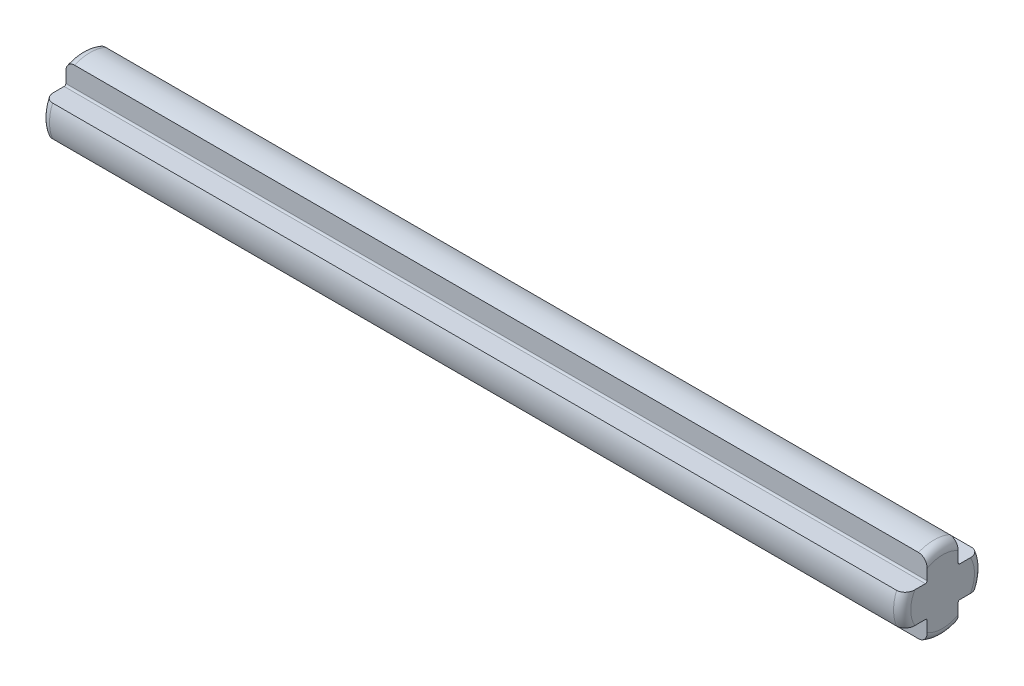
ISO-10303-21;
HEADER;
FILE_DESCRIPTION(('STEP AP214'),'2;1');
FILE_NAME('part.step','',(''),(''),'','','');
FILE_SCHEMA(('AUTOMOTIVE_DESIGN { 1 0 10303 214 1 1 1 1 }'));
ENDSEC;
DATA;
#1=APPLICATION_CONTEXT('core data for automotive mechanical design processes');
#2=APPLICATION_PROTOCOL_DEFINITION('international standard','automotive_design',2000,#1);
#3=PRODUCT_CONTEXT('',#1,'mechanical');
#4=PRODUCT('Part','Part','',(#3));
#5=PRODUCT_RELATED_PRODUCT_CATEGORY('part','',(#4));
#6=PRODUCT_DEFINITION_FORMATION('','',#4);
#7=PRODUCT_DEFINITION_CONTEXT('part definition',#1,'design');
#8=PRODUCT_DEFINITION('design','',#6,#7);
#9=PRODUCT_DEFINITION_SHAPE('','',#8);
#10=(LENGTH_UNIT() NAMED_UNIT(*) SI_UNIT(.MILLI.,.METRE.));
#11=(NAMED_UNIT(*) PLANE_ANGLE_UNIT() SI_UNIT($,.RADIAN.));
#12=(NAMED_UNIT(*) SI_UNIT($,.STERADIAN.) SOLID_ANGLE_UNIT());
#13=UNCERTAINTY_MEASURE_WITH_UNIT(LENGTH_MEASURE(1.E-05),#10,'distance_accuracy_value','');
#14=(GEOMETRIC_REPRESENTATION_CONTEXT(3) GLOBAL_UNCERTAINTY_ASSIGNED_CONTEXT((#13)) GLOBAL_UNIT_ASSIGNED_CONTEXT((#10,
#11,#12)) REPRESENTATION_CONTEXT('',''));
#15=CARTESIAN_POINT('',(0.,0.,0.));
#16=DIRECTION('',(0.,0.,1.));
#17=DIRECTION('',(1.,0.,0.));
#18=AXIS2_PLACEMENT_3D('',#15,#16,#17);
#19=CARTESIAN_POINT('',(25.,0.,0.));
#20=DIRECTION('',(-1.,0.,0.));
#21=DIRECTION('',(0.,0.,1.));
#22=AXIS2_PLACEMENT_3D('',#19,#20,#21);
#23=CYLINDRICAL_SURFACE('',#22,2.35);
#24=DIRECTION('',(-1.,0.,0.));
#25=VECTOR('',#24,1.);
#26=CARTESIAN_POINT('',(25.,0.9,2.17082933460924));
#27=LINE('',#26,#25);
#28=CARTESIAN_POINT('',(24.5,0.9,2.17082933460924));
#29=VERTEX_POINT('',#28);
#30=CARTESIAN_POINT('',(-24.5,0.9,2.17082933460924));
#31=VERTEX_POINT('',#30);
#32=EDGE_CURVE('E250',#29,#31,#27,.T.);
#33=ORIENTED_EDGE('',*,*,#32,.T.);
#34=CARTESIAN_POINT('',(-24.5,0.,0.));
#35=DIRECTION('',(1.,0.,0.));
#36=DIRECTION('',(0.,0.,-1.));
#37=AXIS2_PLACEMENT_3D('',#34,#35,#36);
#38=CIRCLE('',#37,2.35);
#39=CARTESIAN_POINT('',(-24.5,-0.900000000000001,2.17082933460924));
#40=VERTEX_POINT('',#39);
#41=EDGE_CURVE('E515',#31,#40,#38,.T.);
#42=ORIENTED_EDGE('',*,*,#41,.T.);
#43=DIRECTION('',(-1.,0.,0.));
#44=VECTOR('',#43,1.);
#45=CARTESIAN_POINT('',(25.,-0.900000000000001,2.17082933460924));
#46=LINE('',#45,#44);
#47=CARTESIAN_POINT('',(24.5,-0.900000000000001,2.17082933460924));
#48=VERTEX_POINT('',#47);
#49=EDGE_CURVE('E221',#48,#40,#46,.T.);
#50=ORIENTED_EDGE('',*,*,#49,.F.);
#51=CARTESIAN_POINT('',(24.5,0.,0.));
#52=DIRECTION('',(1.,0.,0.));
#53=DIRECTION('',(0.,0.,-1.));
#54=AXIS2_PLACEMENT_3D('',#51,#52,#53);
#55=CIRCLE('',#54,2.35);
#56=EDGE_CURVE('E370',#48,#29,#55,.F.);
#57=ORIENTED_EDGE('',*,*,#56,.T.);
#58=EDGE_LOOP('',(#33,#42,#50,#57));
#59=FACE_BOUND('',#58,.T.);
#60=ADVANCED_FACE('F37',(#59),#23,.T.);
#61=CARTESIAN_POINT('',(25.,-0.900000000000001,2.17082933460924));
#62=DIRECTION('',(0.,1.,0.));
#63=DIRECTION('',(0.,0.,1.));
#64=AXIS2_PLACEMENT_3D('',#61,#62,#63);
#65=PLANE('',#64);
#66=ORIENTED_EDGE('',*,*,#49,.T.);
#67=CARTESIAN_POINT('',(-24.5,-0.900000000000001,2.17082933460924));
#68=CARTESIAN_POINT('',(-24.5264833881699,-0.900000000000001,2.17085986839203));
#69=CARTESIAN_POINT('',(-24.5529498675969,-0.900000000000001,2.16855372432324));
#70=CARTESIAN_POINT('',(-24.6050453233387,-0.900000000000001,2.15950506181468));
#71=CARTESIAN_POINT('',(-24.6306762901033,-0.900000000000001,2.15277404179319));
#72=CARTESIAN_POINT('',(-24.6804387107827,-0.900000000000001,2.1351114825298));
#73=CARTESIAN_POINT('',(-24.7045703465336,-0.900000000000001,2.12418045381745));
#74=CARTESIAN_POINT('',(-24.7507251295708,-0.900000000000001,2.09852306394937));
#75=CARTESIAN_POINT('',(-24.7727475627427,-0.900000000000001,2.0837954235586));
#76=CARTESIAN_POINT('',(-24.8147234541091,-0.900000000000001,2.05060839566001));
#77=CARTESIAN_POINT('',(-24.8346070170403,-0.900000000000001,2.03206082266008));
#78=CARTESIAN_POINT('',(-24.8712243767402,-0.900000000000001,1.99209288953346));
#79=CARTESIAN_POINT('',(-24.8879579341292,-0.900000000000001,1.97067231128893));
#80=CARTESIAN_POINT('',(-24.9190973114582,-0.900000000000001,1.92396602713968));
#81=CARTESIAN_POINT('',(-24.9332527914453,-0.900000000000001,1.89851375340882));
#82=CARTESIAN_POINT('',(-24.9575247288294,-0.900000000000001,1.84573102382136));
#83=CARTESIAN_POINT('',(-24.9676367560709,-0.900000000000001,1.81839854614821));
#84=CARTESIAN_POINT('',(-24.9838866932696,-0.900000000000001,1.76219756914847));
#85=CARTESIAN_POINT('',(-24.9899702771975,-0.900000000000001,1.73331353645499));
#86=CARTESIAN_POINT('',(-24.9980270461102,-0.900000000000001,1.67505065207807));
#87=CARTESIAN_POINT('',(-25.0000109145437,-0.900000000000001,1.64567328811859));
#88=CARTESIAN_POINT('',(-25.,-0.900000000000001,1.61632298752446));
#89=B_SPLINE_CURVE_WITH_KNOTS('',3,(#67,#68,#69,#70,#71,#72,#73,#74,#75,#76,#77,#78,#79,#80,#81,
#82,#83,#84,#85,#86,#87,#88),.UNSPECIFIED.,.F.,.F.,(4,2,2,2,2,2,2,2,2,2,4),(0.,
0.0793238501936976,0.158442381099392,0.237551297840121,0.316686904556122,0.39790986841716,
0.479139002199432,0.566147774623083,0.653251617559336,0.741507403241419,0.829532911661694),.UNSPECIFIED.);
#90=CARTESIAN_POINT('',(-25.,-0.900000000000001,1.61632298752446));
#91=VERTEX_POINT('',#90);
#92=EDGE_CURVE('E390',#40,#91,#89,.T.);
#93=ORIENTED_EDGE('',*,*,#92,.T.);
#94=DIRECTION('',(0.,0.,-1.));
#95=VECTOR('',#94,1.);
#96=CARTESIAN_POINT('',(-25.,-0.900000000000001,2.17082933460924));
#97=LINE('',#96,#95);
#98=CARTESIAN_POINT('',(-25.,-0.900000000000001,0.999999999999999));
#99=VERTEX_POINT('',#98);
#100=EDGE_CURVE('E218',#91,#99,#97,.T.);
#101=ORIENTED_EDGE('',*,*,#100,.T.);
#102=DIRECTION('',(-1.,0.,0.));
#103=VECTOR('',#102,1.);
#104=CARTESIAN_POINT('',(25.,-0.900000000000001,0.999999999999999));
#105=LINE('',#104,#103);
#106=CARTESIAN_POINT('',(25.,-0.900000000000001,0.999999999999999));
#107=VERTEX_POINT('',#106);
#108=EDGE_CURVE('E214',#107,#99,#105,.T.);
#109=ORIENTED_EDGE('',*,*,#108,.F.);
#110=DIRECTION('',(0.,0.,-1.));
#111=VECTOR('',#110,1.);
#112=CARTESIAN_POINT('',(25.,-0.900000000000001,2.17082933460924));
#113=LINE('',#112,#111);
#114=CARTESIAN_POINT('',(25.,-0.900000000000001,1.61632298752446));
#115=VERTEX_POINT('',#114);
#116=EDGE_CURVE('E201',#115,#107,#113,.T.);
#117=ORIENTED_EDGE('',*,*,#116,.F.);
#118=CARTESIAN_POINT('',(25.,-0.900000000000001,1.61632298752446));
#119=CARTESIAN_POINT('',(25.0000222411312,-0.900000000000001,1.65066661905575));
#120=CARTESIAN_POINT('',(24.9972983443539,-0.900000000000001,1.68506058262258));
#121=CARTESIAN_POINT('',(24.9862156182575,-0.900000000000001,1.75308687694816));
#122=CARTESIAN_POINT('',(24.9778303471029,-0.900000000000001,1.78671486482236));
#123=CARTESIAN_POINT('',(24.9552419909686,-0.900000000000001,1.85211366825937));
#124=CARTESIAN_POINT('',(24.9410195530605,-0.900000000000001,1.88387790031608));
#125=CARTESIAN_POINT('',(24.9069131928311,-0.900000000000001,1.94414749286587));
#126=CARTESIAN_POINT('',(24.8870416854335,-0.900000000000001,1.97265980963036));
#127=CARTESIAN_POINT('',(24.844222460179,-0.900000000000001,2.02268935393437));
#128=CARTESIAN_POINT('',(24.8217526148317,-0.900000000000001,2.04461521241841));
#129=CARTESIAN_POINT('',(24.7730890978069,-0.900000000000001,2.08389547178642));
#130=CARTESIAN_POINT('',(24.7468952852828,-0.900000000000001,2.10124969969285));
#131=CARTESIAN_POINT('',(24.6943438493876,-0.900000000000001,2.12912089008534));
#132=CARTESIAN_POINT('',(24.6682509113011,-0.900000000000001,2.14013932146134));
#133=CARTESIAN_POINT('',(24.6145341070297,-0.900000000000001,2.15730052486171));
#134=CARTESIAN_POINT('',(24.586913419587,-0.900000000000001,2.1634530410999));
#135=CARTESIAN_POINT('',(24.5492135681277,-0.900000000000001,2.16830749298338));
#136=CARTESIAN_POINT('',(24.5393866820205,-0.900000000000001,2.1692533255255));
#137=CARTESIAN_POINT('',(24.5197081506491,-0.900000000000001,2.17051341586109));
#138=CARTESIAN_POINT('',(24.5098565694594,-0.900000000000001,2.17082867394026));
#139=CARTESIAN_POINT('',(24.5,-0.900000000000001,2.17082933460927));
#140=B_SPLINE_CURVE_WITH_KNOTS('',3,(#118,#119,#120,#121,#122,#123,#124,#125,#126,#127,#128,
#129,#130,#131,#132,#133,#134,#135,#136,#137,#138,#139),.UNSPECIFIED.,.F.,.F.,(4,2,2,2,2,2,2,2,
2,2,4),(0.,0.10300027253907,0.206484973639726,0.31031558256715,0.413919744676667,
0.507586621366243,0.60125704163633,0.685799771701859,0.770172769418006,0.79977449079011,
0.829329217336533),.UNSPECIFIED.);
#141=EDGE_CURVE('E520',#115,#48,#140,.T.);
#142=ORIENTED_EDGE('',*,*,#141,.T.);
#143=EDGE_LOOP('',(#66,#93,#101,#109,#117,#142));
#144=FACE_BOUND('',#143,.T.);
#145=ADVANCED_FACE('F216',(#144),#65,.F.);
#146=CARTESIAN_POINT('',(25.,-1.,0.999999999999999));
#147=DIRECTION('',(-1.,0.,0.));
#148=DIRECTION('',(0.,0.,1.));
#149=AXIS2_PLACEMENT_3D('',#146,#147,#148);
#150=CYLINDRICAL_SURFACE('',#149,0.0999999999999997);
#151=CARTESIAN_POINT('',(-25.,-1.,0.999999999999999));
#152=DIRECTION('',(-1.,0.,0.));
#153=DIRECTION('',(0.,0.,1.));
#154=AXIS2_PLACEMENT_3D('',#151,#152,#153);
#155=CIRCLE('',#154,0.0999999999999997);
#156=CARTESIAN_POINT('',(-25.,-1.,0.899999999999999));
#157=VERTEX_POINT('',#156);
#158=EDGE_CURVE('E252',#99,#157,#155,.T.);
#159=ORIENTED_EDGE('',*,*,#158,.T.);
#160=DIRECTION('',(-1.,0.,0.));
#161=VECTOR('',#160,1.);
#162=CARTESIAN_POINT('',(25.,-1.,0.899999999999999));
#163=LINE('',#162,#161);
#164=CARTESIAN_POINT('',(25.,-1.,0.899999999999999));
#165=VERTEX_POINT('',#164);
#166=EDGE_CURVE('E222',#165,#157,#163,.T.);
#167=ORIENTED_EDGE('',*,*,#166,.F.);
#168=CARTESIAN_POINT('',(25.,-1.,0.999999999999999));
#169=DIRECTION('',(-1.,0.,0.));
#170=DIRECTION('',(0.,0.,1.));
#171=AXIS2_PLACEMENT_3D('',#168,#169,#170);
#172=CIRCLE('',#171,0.0999999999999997);
#173=EDGE_CURVE('E207',#107,#165,#172,.T.);
#174=ORIENTED_EDGE('',*,*,#173,.F.);
#175=ORIENTED_EDGE('',*,*,#108,.T.);
#176=EDGE_LOOP('',(#159,#167,#174,#175));
#177=FACE_BOUND('',#176,.T.);
#178=ADVANCED_FACE('F224',(#177),#150,.F.);
#179=CARTESIAN_POINT('',(25.,-2.17082933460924,0.899999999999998));
#180=DIRECTION('',(0.,0.,-1.));
#181=DIRECTION('',(0.,1.,0.));
#182=AXIS2_PLACEMENT_3D('',#179,#180,#181);
#183=PLANE('',#182);
#184=DIRECTION('',(0.,-1.,0.));
#185=VECTOR('',#184,1.);
#186=CARTESIAN_POINT('',(-25.,-2.17082933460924,0.899999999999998));
#187=LINE('',#186,#185);
#188=CARTESIAN_POINT('',(-25.,-1.61632298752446,0.899999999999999));
#189=VERTEX_POINT('',#188);
#190=EDGE_CURVE('E254',#157,#189,#187,.T.);
#191=ORIENTED_EDGE('',*,*,#190,.T.);
#192=CARTESIAN_POINT('',(-25.,-1.61632298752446,0.899999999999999));
#193=CARTESIAN_POINT('',(-25.0000222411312,-1.65066661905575,0.899999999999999));
#194=CARTESIAN_POINT('',(-24.9972983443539,-1.68506058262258,0.899999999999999));
#195=CARTESIAN_POINT('',(-24.9862156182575,-1.75308687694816,0.899999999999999));
#196=CARTESIAN_POINT('',(-24.9778303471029,-1.78671486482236,0.899999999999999));
#197=CARTESIAN_POINT('',(-24.9552419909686,-1.85211366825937,0.899999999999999));
#198=CARTESIAN_POINT('',(-24.9410195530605,-1.88387790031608,0.899999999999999));
#199=CARTESIAN_POINT('',(-24.9069131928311,-1.94414749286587,0.899999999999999));
#200=CARTESIAN_POINT('',(-24.8870416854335,-1.97265980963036,0.899999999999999));
#201=CARTESIAN_POINT('',(-24.844222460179,-2.02268935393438,0.899999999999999));
#202=CARTESIAN_POINT('',(-24.8217526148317,-2.04461521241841,0.899999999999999));
#203=CARTESIAN_POINT('',(-24.7730890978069,-2.08389547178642,0.899999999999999));
#204=CARTESIAN_POINT('',(-24.7468952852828,-2.10124969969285,0.899999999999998));
#205=CARTESIAN_POINT('',(-24.6943438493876,-2.12912089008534,0.899999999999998));
#206=CARTESIAN_POINT('',(-24.6682509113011,-2.14013932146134,0.899999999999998));
#207=CARTESIAN_POINT('',(-24.6145341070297,-2.15730052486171,0.899999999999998));
#208=CARTESIAN_POINT('',(-24.586913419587,-2.1634530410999,0.899999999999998));
#209=CARTESIAN_POINT('',(-24.5492135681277,-2.16830749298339,0.899999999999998));
#210=CARTESIAN_POINT('',(-24.5393866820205,-2.1692533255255,0.899999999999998));
#211=CARTESIAN_POINT('',(-24.5197081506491,-2.17051341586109,0.899999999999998));
#212=CARTESIAN_POINT('',(-24.5098565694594,-2.17082867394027,0.899999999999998));
#213=CARTESIAN_POINT('',(-24.5,-2.17082933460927,0.899999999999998));
#214=B_SPLINE_CURVE_WITH_KNOTS('',3,(#192,#193,#194,#195,#196,#197,#198,#199,#200,#201,#202,
#203,#204,#205,#206,#207,#208,#209,#210,#211,#212,#213),.UNSPECIFIED.,.F.,.F.,(4,2,2,2,2,2,2,2,
2,2,4),(0.,0.10300027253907,0.206484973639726,0.310315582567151,0.413919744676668,
0.507586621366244,0.60125704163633,0.685799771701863,0.770172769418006,0.79977449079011,
0.829329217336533),.UNSPECIFIED.);
#215=CARTESIAN_POINT('',(-24.5,-2.17082933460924,0.899999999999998));
#216=VERTEX_POINT('',#215);
#217=EDGE_CURVE('E365',#189,#216,#214,.T.);
#218=ORIENTED_EDGE('',*,*,#217,.T.);
#219=DIRECTION('',(-1.,0.,0.));
#220=VECTOR('',#219,1.);
#221=CARTESIAN_POINT('',(25.,-2.17082933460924,0.899999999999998));
#222=LINE('',#221,#220);
#223=CARTESIAN_POINT('',(24.5,-2.17082933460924,0.899999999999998));
#224=VERTEX_POINT('',#223);
#225=EDGE_CURVE('E312',#224,#216,#222,.T.);
#226=ORIENTED_EDGE('',*,*,#225,.F.);
#227=CARTESIAN_POINT('',(24.5,-2.17082933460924,0.899999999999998));
#228=CARTESIAN_POINT('',(24.5264833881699,-2.17085986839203,0.899999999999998));
#229=CARTESIAN_POINT('',(24.5529498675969,-2.16855372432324,0.899999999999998));
#230=CARTESIAN_POINT('',(24.6050453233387,-2.15950506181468,0.899999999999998));
#231=CARTESIAN_POINT('',(24.6306762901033,-2.15277404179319,0.899999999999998));
#232=CARTESIAN_POINT('',(24.6804387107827,-2.1351114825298,0.899999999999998));
#233=CARTESIAN_POINT('',(24.7045703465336,-2.12418045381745,0.899999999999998));
#234=CARTESIAN_POINT('',(24.7507251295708,-2.09852306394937,0.899999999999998));
#235=CARTESIAN_POINT('',(24.7727475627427,-2.0837954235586,0.899999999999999));
#236=CARTESIAN_POINT('',(24.8147234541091,-2.05060839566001,0.899999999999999));
#237=CARTESIAN_POINT('',(24.8346070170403,-2.03206082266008,0.899999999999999));
#238=CARTESIAN_POINT('',(24.8712243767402,-1.99209288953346,0.899999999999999));
#239=CARTESIAN_POINT('',(24.8879579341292,-1.97067231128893,0.899999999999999));
#240=CARTESIAN_POINT('',(24.9190973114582,-1.92396602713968,0.899999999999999));
#241=CARTESIAN_POINT('',(24.9332527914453,-1.89851375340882,0.899999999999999));
#242=CARTESIAN_POINT('',(24.9575247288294,-1.84573102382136,0.899999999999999));
#243=CARTESIAN_POINT('',(24.9676367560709,-1.81839854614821,0.899999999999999));
#244=CARTESIAN_POINT('',(24.9838866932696,-1.76219756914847,0.899999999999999));
#245=CARTESIAN_POINT('',(24.9899702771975,-1.733313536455,0.899999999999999));
#246=CARTESIAN_POINT('',(24.9980270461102,-1.67505065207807,0.899999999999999));
#247=CARTESIAN_POINT('',(25.0000109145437,-1.64567328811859,0.899999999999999));
#248=CARTESIAN_POINT('',(25.,-1.61632298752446,0.899999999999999));
#249=B_SPLINE_CURVE_WITH_KNOTS('',3,(#227,#228,#229,#230,#231,#232,#233,#234,#235,#236,#237,
#238,#239,#240,#241,#242,#243,#244,#245,#246,#247,#248),.UNSPECIFIED.,.F.,.F.,(4,2,2,2,2,2,2,2,
2,2,4),(0.,0.0793238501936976,0.158442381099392,0.237551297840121,0.316686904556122,
0.397909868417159,0.479139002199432,0.566147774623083,0.653251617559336,0.741507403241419,
0.829532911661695),.UNSPECIFIED.);
#250=CARTESIAN_POINT('',(25.,-1.61632298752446,0.899999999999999));
#251=VERTEX_POINT('',#250);
#252=EDGE_CURVE('E359',#224,#251,#249,.T.);
#253=ORIENTED_EDGE('',*,*,#252,.T.);
#254=DIRECTION('',(0.,-1.,0.));
#255=VECTOR('',#254,1.);
#256=CARTESIAN_POINT('',(25.,-2.17082933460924,0.899999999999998));
#257=LINE('',#256,#255);
#258=EDGE_CURVE('E227',#165,#251,#257,.T.);
#259=ORIENTED_EDGE('',*,*,#258,.F.);
#260=ORIENTED_EDGE('',*,*,#166,.T.);
#261=EDGE_LOOP('',(#191,#218,#226,#253,#259,#260));
#262=FACE_BOUND('',#261,.T.);
#263=ADVANCED_FACE('F350',(#262),#183,.F.);
#264=CARTESIAN_POINT('',(25.,0.,0.));
#265=DIRECTION('',(-1.,0.,0.));
#266=DIRECTION('',(0.,0.,1.));
#267=AXIS2_PLACEMENT_3D('',#264,#265,#266);
#268=CYLINDRICAL_SURFACE('',#267,2.35);
#269=ORIENTED_EDGE('',*,*,#225,.T.);
#270=CARTESIAN_POINT('',(-24.5,0.,0.));
#271=DIRECTION('',(1.,0.,0.));
#272=DIRECTION('',(0.,0.,-1.));
#273=AXIS2_PLACEMENT_3D('',#270,#271,#272);
#274=CIRCLE('',#273,2.35);
#275=CARTESIAN_POINT('',(-24.5,-2.17082933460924,-0.9));
#276=VERTEX_POINT('',#275);
#277=EDGE_CURVE('E319',#216,#276,#274,.T.);
#278=ORIENTED_EDGE('',*,*,#277,.T.);
#279=DIRECTION('',(-1.,0.,0.));
#280=VECTOR('',#279,1.);
#281=CARTESIAN_POINT('',(25.,-2.17082933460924,-0.9));
#282=LINE('',#281,#280);
#283=CARTESIAN_POINT('',(24.5,-2.17082933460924,-0.9));
#284=VERTEX_POINT('',#283);
#285=EDGE_CURVE('E309',#284,#276,#282,.T.);
#286=ORIENTED_EDGE('',*,*,#285,.F.);
#287=CARTESIAN_POINT('',(24.5,0.,0.));
#288=DIRECTION('',(1.,0.,0.));
#289=DIRECTION('',(0.,0.,-1.));
#290=AXIS2_PLACEMENT_3D('',#287,#288,#289);
#291=CIRCLE('',#290,2.35);
#292=EDGE_CURVE('E317',#284,#224,#291,.F.);
#293=ORIENTED_EDGE('',*,*,#292,.T.);
#294=EDGE_LOOP('',(#269,#278,#286,#293));
#295=FACE_BOUND('',#294,.T.);
#296=ADVANCED_FACE('F344',(#295),#268,.T.);
#297=CARTESIAN_POINT('',(25.,-2.17082933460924,-0.9));
#298=DIRECTION('',(0.,0.,1.));
#299=DIRECTION('',(0.,-1.,0.));
#300=AXIS2_PLACEMENT_3D('',#297,#298,#299);
#301=PLANE('',#300);
#302=ORIENTED_EDGE('',*,*,#285,.T.);
#303=CARTESIAN_POINT('',(-24.5,-2.17082933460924,-0.9));
#304=CARTESIAN_POINT('',(-24.5264833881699,-2.17085986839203,-0.9));
#305=CARTESIAN_POINT('',(-24.5529498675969,-2.16855372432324,-0.9));
#306=CARTESIAN_POINT('',(-24.6050453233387,-2.15950506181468,-0.9));
#307=CARTESIAN_POINT('',(-24.6306762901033,-2.15277404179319,-0.9));
#308=CARTESIAN_POINT('',(-24.6804387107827,-2.1351114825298,-0.9));
#309=CARTESIAN_POINT('',(-24.7045703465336,-2.12418045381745,-0.9));
#310=CARTESIAN_POINT('',(-24.7507251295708,-2.09852306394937,-0.9));
#311=CARTESIAN_POINT('',(-24.7727475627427,-2.0837954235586,-0.9));
#312=CARTESIAN_POINT('',(-24.8147234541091,-2.05060839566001,-0.9));
#313=CARTESIAN_POINT('',(-24.8346070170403,-2.03206082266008,-0.9));
#314=CARTESIAN_POINT('',(-24.8712243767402,-1.99209288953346,-0.9));
#315=CARTESIAN_POINT('',(-24.8879579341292,-1.97067231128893,-0.9));
#316=CARTESIAN_POINT('',(-24.9190973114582,-1.92396602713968,-0.9));
#317=CARTESIAN_POINT('',(-24.9332527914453,-1.89851375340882,-0.9));
#318=CARTESIAN_POINT('',(-24.9575247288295,-1.84573102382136,-0.9));
#319=CARTESIAN_POINT('',(-24.9676367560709,-1.81839854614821,-0.9));
#320=CARTESIAN_POINT('',(-24.9838866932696,-1.76219756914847,-0.9));
#321=CARTESIAN_POINT('',(-24.9899702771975,-1.733313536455,-0.9));
#322=CARTESIAN_POINT('',(-24.9980270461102,-1.67505065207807,-0.9));
#323=CARTESIAN_POINT('',(-25.0000109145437,-1.64567328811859,-0.9));
#324=CARTESIAN_POINT('',(-25.,-1.61632298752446,-0.9));
#325=B_SPLINE_CURVE_WITH_KNOTS('',3,(#303,#304,#305,#306,#307,#308,#309,#310,#311,#312,#313,
#314,#315,#316,#317,#318,#319,#320,#321,#322,#323,#324),.UNSPECIFIED.,.F.,.F.,(4,2,2,2,2,2,2,2,
2,2,4),(0.,0.0793238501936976,0.158442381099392,0.237551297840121,0.316686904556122,
0.397909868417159,0.479139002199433,0.566147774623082,0.653251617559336,0.741507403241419,
0.829532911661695),.UNSPECIFIED.);
#326=CARTESIAN_POINT('',(-25.,-1.61632298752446,-0.9));
#327=VERTEX_POINT('',#326);
#328=EDGE_CURVE('E329',#276,#327,#325,.T.);
#329=ORIENTED_EDGE('',*,*,#328,.T.);
#330=DIRECTION('',(0.,1.,0.));
#331=VECTOR('',#330,1.);
#332=CARTESIAN_POINT('',(-25.,-2.17082933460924,-0.9));
#333=LINE('',#332,#331);
#334=CARTESIAN_POINT('',(-25.,-1.,-0.9));
#335=VERTEX_POINT('',#334);
#336=EDGE_CURVE('E257',#327,#335,#333,.T.);
#337=ORIENTED_EDGE('',*,*,#336,.T.);
#338=DIRECTION('',(-1.,0.,0.));
#339=VECTOR('',#338,1.);
#340=CARTESIAN_POINT('',(25.,-1.,-0.9));
#341=LINE('',#340,#339);
#342=CARTESIAN_POINT('',(25.,-1.,-0.9));
#343=VERTEX_POINT('',#342);
#344=EDGE_CURVE('E306',#343,#335,#341,.T.);
#345=ORIENTED_EDGE('',*,*,#344,.F.);
#346=DIRECTION('',(0.,1.,0.));
#347=VECTOR('',#346,1.);
#348=CARTESIAN_POINT('',(25.,-2.17082933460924,-0.9));
#349=LINE('',#348,#347);
#350=CARTESIAN_POINT('',(25.,-1.61632298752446,-0.9));
#351=VERTEX_POINT('',#350);
#352=EDGE_CURVE('E229',#351,#343,#349,.T.);
#353=ORIENTED_EDGE('',*,*,#352,.F.);
#354=CARTESIAN_POINT('',(25.,-1.61632298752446,-0.9));
#355=CARTESIAN_POINT('',(25.0000222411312,-1.65066661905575,-0.9));
#356=CARTESIAN_POINT('',(24.9972983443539,-1.68506058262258,-0.9));
#357=CARTESIAN_POINT('',(24.9862156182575,-1.75308687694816,-0.9));
#358=CARTESIAN_POINT('',(24.9778303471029,-1.78671486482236,-0.9));
#359=CARTESIAN_POINT('',(24.9552419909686,-1.85211366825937,-0.9));
#360=CARTESIAN_POINT('',(24.9410195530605,-1.88387790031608,-0.9));
#361=CARTESIAN_POINT('',(24.9069131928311,-1.94414749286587,-0.9));
#362=CARTESIAN_POINT('',(24.8870416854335,-1.97265980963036,-0.9));
#363=CARTESIAN_POINT('',(24.844222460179,-2.02268935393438,-0.9));
#364=CARTESIAN_POINT('',(24.8217526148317,-2.04461521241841,-0.9));
#365=CARTESIAN_POINT('',(24.7730890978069,-2.08389547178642,-0.9));
#366=CARTESIAN_POINT('',(24.7468952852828,-2.10124969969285,-0.9));
#367=CARTESIAN_POINT('',(24.6943438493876,-2.12912089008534,-0.9));
#368=CARTESIAN_POINT('',(24.6682509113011,-2.14013932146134,-0.9));
#369=CARTESIAN_POINT('',(24.6145341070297,-2.15730052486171,-0.9));
#370=CARTESIAN_POINT('',(24.586913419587,-2.1634530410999,-0.9));
#371=CARTESIAN_POINT('',(24.5492135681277,-2.16830749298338,-0.9));
#372=CARTESIAN_POINT('',(24.5393866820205,-2.1692533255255,-0.9));
#373=CARTESIAN_POINT('',(24.5197081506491,-2.17051341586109,-0.9));
#374=CARTESIAN_POINT('',(24.5098565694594,-2.17082867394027,-0.9));
#375=CARTESIAN_POINT('',(24.5,-2.17082933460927,-0.9));
#376=B_SPLINE_CURVE_WITH_KNOTS('',3,(#354,#355,#356,#357,#358,#359,#360,#361,#362,#363,#364,
#365,#366,#367,#368,#369,#370,#371,#372,#373,#374,#375),.UNSPECIFIED.,.F.,.F.,(4,2,2,2,2,2,2,2,
2,2,4),(0.,0.10300027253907,0.206484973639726,0.310315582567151,0.413919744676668,
0.507586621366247,0.601257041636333,0.685799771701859,0.770172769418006,0.79977449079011,
0.829329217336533),.UNSPECIFIED.);
#377=EDGE_CURVE('E322',#351,#284,#376,.T.);
#378=ORIENTED_EDGE('',*,*,#377,.T.);
#379=EDGE_LOOP('',(#302,#329,#337,#345,#353,#378));
#380=FACE_BOUND('',#379,.T.);
#381=ADVANCED_FACE('F338',(#380),#301,.F.);
#382=CARTESIAN_POINT('',(25.,-1.,-1.));
#383=DIRECTION('',(-1.,0.,0.));
#384=DIRECTION('',(0.,0.,1.));
#385=AXIS2_PLACEMENT_3D('',#382,#383,#384);
#386=CYLINDRICAL_SURFACE('',#385,0.0999999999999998);
#387=CARTESIAN_POINT('',(-25.,-1.,-1.));
#388=DIRECTION('',(-1.,0.,0.));
#389=DIRECTION('',(0.,0.,-1.));
#390=AXIS2_PLACEMENT_3D('',#387,#388,#389);
#391=CIRCLE('',#390,0.0999999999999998);
#392=CARTESIAN_POINT('',(-25.,-0.9,-1.));
#393=VERTEX_POINT('',#392);
#394=EDGE_CURVE('E259',#335,#393,#391,.T.);
#395=ORIENTED_EDGE('',*,*,#394,.T.);
#396=DIRECTION('',(-1.,0.,0.));
#397=VECTOR('',#396,1.);
#398=CARTESIAN_POINT('',(25.,-0.9,-1.));
#399=LINE('',#398,#397);
#400=CARTESIAN_POINT('',(25.,-0.9,-1.));
#401=VERTEX_POINT('',#400);
#402=EDGE_CURVE('E303',#401,#393,#399,.T.);
#403=ORIENTED_EDGE('',*,*,#402,.F.);
#404=CARTESIAN_POINT('',(25.,-1.,-1.));
#405=DIRECTION('',(-1.,0.,0.));
#406=DIRECTION('',(0.,0.,-1.));
#407=AXIS2_PLACEMENT_3D('',#404,#405,#406);
#408=CIRCLE('',#407,0.0999999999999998);
#409=EDGE_CURVE('E233',#343,#401,#408,.T.);
#410=ORIENTED_EDGE('',*,*,#409,.F.);
#411=ORIENTED_EDGE('',*,*,#344,.T.);
#412=EDGE_LOOP('',(#395,#403,#410,#411));
#413=FACE_BOUND('',#412,.T.);
#414=ADVANCED_FACE('F343',(#413),#386,.F.);
#415=CARTESIAN_POINT('',(25.,-0.900000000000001,-2.17082933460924));
#416=DIRECTION('',(0.,1.,0.));
#417=DIRECTION('',(0.,0.,1.));
#418=AXIS2_PLACEMENT_3D('',#415,#416,#417);
#419=PLANE('',#418);
#420=DIRECTION('',(0.,0.,-1.));
#421=VECTOR('',#420,1.);
#422=CARTESIAN_POINT('',(-25.,-0.900000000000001,-2.17082933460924));
#423=LINE('',#422,#421);
#424=CARTESIAN_POINT('',(-25.,-0.9,-1.61632298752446));
#425=VERTEX_POINT('',#424);
#426=EDGE_CURVE('E261',#393,#425,#423,.T.);
#427=ORIENTED_EDGE('',*,*,#426,.T.);
#428=CARTESIAN_POINT('',(-25.,-0.9,-1.61632298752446));
#429=CARTESIAN_POINT('',(-25.0000222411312,-0.9,-1.65066661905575));
#430=CARTESIAN_POINT('',(-24.9972983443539,-0.9,-1.68506058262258));
#431=CARTESIAN_POINT('',(-24.9862156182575,-0.9,-1.75308687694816));
#432=CARTESIAN_POINT('',(-24.9778303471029,-0.9,-1.78671486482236));
#433=CARTESIAN_POINT('',(-24.9552419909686,-0.9,-1.85211366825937));
#434=CARTESIAN_POINT('',(-24.9410195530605,-0.9,-1.88387790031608));
#435=CARTESIAN_POINT('',(-24.9069131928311,-0.9,-1.94414749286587));
#436=CARTESIAN_POINT('',(-24.8870416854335,-0.9,-1.97265980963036));
#437=CARTESIAN_POINT('',(-24.844222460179,-0.9,-2.02268935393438));
#438=CARTESIAN_POINT('',(-24.8217526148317,-0.900000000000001,-2.04461521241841));
#439=CARTESIAN_POINT('',(-24.7730890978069,-0.900000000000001,-2.08389547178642));
#440=CARTESIAN_POINT('',(-24.7468952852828,-0.900000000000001,-2.10124969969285));
#441=CARTESIAN_POINT('',(-24.6943438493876,-0.900000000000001,-2.12912089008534));
#442=CARTESIAN_POINT('',(-24.6682509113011,-0.900000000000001,-2.14013932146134));
#443=CARTESIAN_POINT('',(-24.6145341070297,-0.900000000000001,-2.15730052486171));
#444=CARTESIAN_POINT('',(-24.586913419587,-0.900000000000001,-2.1634530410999));
#445=CARTESIAN_POINT('',(-24.5492135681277,-0.900000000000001,-2.16830749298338));
#446=CARTESIAN_POINT('',(-24.5393866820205,-0.900000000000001,-2.1692533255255));
#447=CARTESIAN_POINT('',(-24.5197081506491,-0.900000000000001,-2.17051341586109));
#448=CARTESIAN_POINT('',(-24.5098565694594,-0.900000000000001,-2.17082867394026));
#449=CARTESIAN_POINT('',(-24.5,-0.900000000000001,-2.17082933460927));
#450=B_SPLINE_CURVE_WITH_KNOTS('',3,(#428,#429,#430,#431,#432,#433,#434,#435,#436,#437,#438,
#439,#440,#441,#442,#443,#444,#445,#446,#447,#448,#449),.UNSPECIFIED.,.F.,.F.,(4,2,2,2,2,2,2,2,
2,2,4),(0.,0.10300027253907,0.206484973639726,0.31031558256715,0.413919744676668,
0.50758662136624,0.60125704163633,0.685799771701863,0.770172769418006,0.79977449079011,
0.829329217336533),.UNSPECIFIED.);
#451=CARTESIAN_POINT('',(-24.5,-0.9,-2.17082933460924));
#452=VERTEX_POINT('',#451);
#453=EDGE_CURVE('E489',#425,#452,#450,.T.);
#454=ORIENTED_EDGE('',*,*,#453,.T.);
#455=DIRECTION('',(-1.,0.,0.));
#456=VECTOR('',#455,1.);
#457=CARTESIAN_POINT('',(25.,-0.9,-2.17082933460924));
#458=LINE('',#457,#456);
#459=CARTESIAN_POINT('',(24.5,-0.9,-2.17082933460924));
#460=VERTEX_POINT('',#459);
#461=EDGE_CURVE('E300',#460,#452,#458,.T.);
#462=ORIENTED_EDGE('',*,*,#461,.F.);
#463=CARTESIAN_POINT('',(24.5,-0.9,-2.17082933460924));
#464=CARTESIAN_POINT('',(24.5264833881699,-0.9,-2.17085986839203));
#465=CARTESIAN_POINT('',(24.5529498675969,-0.900000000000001,-2.16855372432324));
#466=CARTESIAN_POINT('',(24.6050453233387,-0.900000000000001,-2.15950506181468));
#467=CARTESIAN_POINT('',(24.6306762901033,-0.900000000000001,-2.15277404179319));
#468=CARTESIAN_POINT('',(24.6804387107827,-0.900000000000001,-2.1351114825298));
#469=CARTESIAN_POINT('',(24.7045703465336,-0.900000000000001,-2.12418045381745));
#470=CARTESIAN_POINT('',(24.7507251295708,-0.900000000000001,-2.09852306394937));
#471=CARTESIAN_POINT('',(24.7727475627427,-0.900000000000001,-2.0837954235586));
#472=CARTESIAN_POINT('',(24.8147234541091,-0.900000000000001,-2.05060839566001));
#473=CARTESIAN_POINT('',(24.8346070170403,-0.9,-2.03206082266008));
#474=CARTESIAN_POINT('',(24.8712243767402,-0.9,-1.99209288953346));
#475=CARTESIAN_POINT('',(24.8879579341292,-0.9,-1.97067231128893));
#476=CARTESIAN_POINT('',(24.9190973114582,-0.9,-1.92396602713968));
#477=CARTESIAN_POINT('',(24.9332527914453,-0.9,-1.89851375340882));
#478=CARTESIAN_POINT('',(24.9575247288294,-0.9,-1.84573102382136));
#479=CARTESIAN_POINT('',(24.9676367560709,-0.9,-1.81839854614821));
#480=CARTESIAN_POINT('',(24.9838866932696,-0.9,-1.76219756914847));
#481=CARTESIAN_POINT('',(24.9899702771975,-0.9,-1.733313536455));
#482=CARTESIAN_POINT('',(24.9980270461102,-0.9,-1.67505065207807));
#483=CARTESIAN_POINT('',(25.0000109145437,-0.9,-1.64567328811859));
#484=CARTESIAN_POINT('',(25.,-0.9,-1.61632298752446));
#485=B_SPLINE_CURVE_WITH_KNOTS('',3,(#463,#464,#465,#466,#467,#468,#469,#470,#471,#472,#473,
#474,#475,#476,#477,#478,#479,#480,#481,#482,#483,#484),.UNSPECIFIED.,.F.,.F.,(4,2,2,2,2,2,2,2,
2,2,4),(0.,0.0793238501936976,0.158442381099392,0.237551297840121,0.316686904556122,
0.39790986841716,0.479139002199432,0.566147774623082,0.653251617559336,0.741507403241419,
0.829532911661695),.UNSPECIFIED.);
#486=CARTESIAN_POINT('',(25.,-0.9,-1.61632298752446));
#487=VERTEX_POINT('',#486);
#488=EDGE_CURVE('E53',#460,#487,#485,.T.);
#489=ORIENTED_EDGE('',*,*,#488,.T.);
#490=DIRECTION('',(0.,0.,-1.));
#491=VECTOR('',#490,1.);
#492=CARTESIAN_POINT('',(25.,-0.900000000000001,-2.17082933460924));
#493=LINE('',#492,#491);
#494=EDGE_CURVE('E235',#401,#487,#493,.T.);
#495=ORIENTED_EDGE('',*,*,#494,.F.);
#496=ORIENTED_EDGE('',*,*,#402,.T.);
#497=EDGE_LOOP('',(#427,#454,#462,#489,#495,#496));
#498=FACE_BOUND('',#497,.T.);
#499=ADVANCED_FACE('F496',(#498),#419,.F.);
#500=CARTESIAN_POINT('',(25.,0.,0.));
#501=DIRECTION('',(-1.,0.,0.));
#502=DIRECTION('',(0.,0.,1.));
#503=AXIS2_PLACEMENT_3D('',#500,#501,#502);
#504=CYLINDRICAL_SURFACE('',#503,2.35);
#505=ORIENTED_EDGE('',*,*,#461,.T.);
#506=CARTESIAN_POINT('',(-24.5,0.,0.));
#507=DIRECTION('',(1.,0.,0.));
#508=DIRECTION('',(0.,0.,-1.));
#509=AXIS2_PLACEMENT_3D('',#506,#507,#508);
#510=CIRCLE('',#509,2.35);
#511=CARTESIAN_POINT('',(-24.5,0.900000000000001,-2.17082933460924));
#512=VERTEX_POINT('',#511);
#513=EDGE_CURVE('E575',#452,#512,#510,.T.);
#514=ORIENTED_EDGE('',*,*,#513,.T.);
#515=DIRECTION('',(-1.,0.,0.));
#516=VECTOR('',#515,1.);
#517=CARTESIAN_POINT('',(25.,0.900000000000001,-2.17082933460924));
#518=LINE('',#517,#516);
#519=CARTESIAN_POINT('',(24.5,0.900000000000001,-2.17082933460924));
#520=VERTEX_POINT('',#519);
#521=EDGE_CURVE('E297',#520,#512,#518,.T.);
#522=ORIENTED_EDGE('',*,*,#521,.F.);
#523=CARTESIAN_POINT('',(24.5,0.,0.));
#524=DIRECTION('',(1.,0.,0.));
#525=DIRECTION('',(0.,0.,-1.));
#526=AXIS2_PLACEMENT_3D('',#523,#524,#525);
#527=CIRCLE('',#526,2.35);
#528=EDGE_CURVE('E574',#520,#460,#527,.F.);
#529=ORIENTED_EDGE('',*,*,#528,.T.);
#530=EDGE_LOOP('',(#505,#514,#522,#529));
#531=FACE_BOUND('',#530,.T.);
#532=ADVANCED_FACE('F464',(#531),#504,.T.);
#533=CARTESIAN_POINT('',(25.,0.900000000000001,-2.17082933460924));
#534=DIRECTION('',(0.,-1.,0.));
#535=DIRECTION('',(0.,0.,-1.));
#536=AXIS2_PLACEMENT_3D('',#533,#534,#535);
#537=PLANE('',#536);
#538=ORIENTED_EDGE('',*,*,#521,.T.);
#539=CARTESIAN_POINT('',(-24.5,0.900000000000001,-2.17082933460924));
#540=CARTESIAN_POINT('',(-24.5264833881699,0.900000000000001,-2.17085986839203));
#541=CARTESIAN_POINT('',(-24.5529498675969,0.900000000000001,-2.16855372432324));
#542=CARTESIAN_POINT('',(-24.6050453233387,0.900000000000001,-2.15950506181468));
#543=CARTESIAN_POINT('',(-24.6306762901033,0.900000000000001,-2.15277404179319));
#544=CARTESIAN_POINT('',(-24.6804387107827,0.900000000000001,-2.1351114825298));
#545=CARTESIAN_POINT('',(-24.7045703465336,0.900000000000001,-2.12418045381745));
#546=CARTESIAN_POINT('',(-24.7507251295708,0.900000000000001,-2.09852306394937));
#547=CARTESIAN_POINT('',(-24.7727475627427,0.900000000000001,-2.0837954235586));
#548=CARTESIAN_POINT('',(-24.8147234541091,0.900000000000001,-2.05060839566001));
#549=CARTESIAN_POINT('',(-24.8346070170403,0.9,-2.03206082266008));
#550=CARTESIAN_POINT('',(-24.8712243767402,0.9,-1.99209288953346));
#551=CARTESIAN_POINT('',(-24.8879579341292,0.9,-1.97067231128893));
#552=CARTESIAN_POINT('',(-24.9190973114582,0.9,-1.92396602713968));
#553=CARTESIAN_POINT('',(-24.9332527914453,0.9,-1.89851375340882));
#554=CARTESIAN_POINT('',(-24.9575247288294,0.9,-1.84573102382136));
#555=CARTESIAN_POINT('',(-24.9676367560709,0.9,-1.81839854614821));
#556=CARTESIAN_POINT('',(-24.9838866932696,0.9,-1.76219756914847));
#557=CARTESIAN_POINT('',(-24.9899702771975,0.9,-1.733313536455));
#558=CARTESIAN_POINT('',(-24.9980270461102,0.9,-1.67505065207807));
#559=CARTESIAN_POINT('',(-25.0000109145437,0.9,-1.64567328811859));
#560=CARTESIAN_POINT('',(-25.,0.9,-1.61632298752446));
#561=B_SPLINE_CURVE_WITH_KNOTS('',3,(#539,#540,#541,#542,#543,#544,#545,#546,#547,#548,#549,
#550,#551,#552,#553,#554,#555,#556,#557,#558,#559,#560),.UNSPECIFIED.,.F.,.F.,(4,2,2,2,2,2,2,2,
2,2,4),(0.,0.0793238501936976,0.158442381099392,0.237551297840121,0.316686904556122,
0.39790986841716,0.479139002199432,0.566147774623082,0.653251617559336,0.741507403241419,
0.829532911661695),.UNSPECIFIED.);
#562=CARTESIAN_POINT('',(-25.,0.9,-1.61632298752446));
#563=VERTEX_POINT('',#562);
#564=EDGE_CURVE('E473',#512,#563,#561,.T.);
#565=ORIENTED_EDGE('',*,*,#564,.T.);
#566=DIRECTION('',(0.,0.,1.));
#567=VECTOR('',#566,1.);
#568=CARTESIAN_POINT('',(-25.,0.900000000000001,-2.17082933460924));
#569=LINE('',#568,#567);
#570=CARTESIAN_POINT('',(-25.,0.9,-1.));
#571=VERTEX_POINT('',#570);
#572=EDGE_CURVE('E264',#563,#571,#569,.T.);
#573=ORIENTED_EDGE('',*,*,#572,.T.);
#574=DIRECTION('',(-1.,0.,0.));
#575=VECTOR('',#574,1.);
#576=CARTESIAN_POINT('',(25.,0.9,-1.));
#577=LINE('',#576,#575);
#578=CARTESIAN_POINT('',(25.,0.9,-1.));
#579=VERTEX_POINT('',#578);
#580=EDGE_CURVE('E294',#579,#571,#577,.T.);
#581=ORIENTED_EDGE('',*,*,#580,.F.);
#582=DIRECTION('',(0.,0.,1.));
#583=VECTOR('',#582,1.);
#584=CARTESIAN_POINT('',(25.,0.900000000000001,-2.17082933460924));
#585=LINE('',#584,#583);
#586=CARTESIAN_POINT('',(25.,0.9,-1.61632298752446));
#587=VERTEX_POINT('',#586);
#588=EDGE_CURVE('E237',#587,#579,#585,.T.);
#589=ORIENTED_EDGE('',*,*,#588,.F.);
#590=CARTESIAN_POINT('',(25.,0.9,-1.61632298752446));
#591=CARTESIAN_POINT('',(25.0000222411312,0.9,-1.65066661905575));
#592=CARTESIAN_POINT('',(24.9972983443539,0.9,-1.68506058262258));
#593=CARTESIAN_POINT('',(24.9862156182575,0.9,-1.75308687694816));
#594=CARTESIAN_POINT('',(24.9778303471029,0.9,-1.78671486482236));
#595=CARTESIAN_POINT('',(24.9552419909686,0.9,-1.85211366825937));
#596=CARTESIAN_POINT('',(24.9410195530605,0.9,-1.88387790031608));
#597=CARTESIAN_POINT('',(24.9069131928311,0.9,-1.94414749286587));
#598=CARTESIAN_POINT('',(24.8870416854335,0.9,-1.97265980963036));
#599=CARTESIAN_POINT('',(24.844222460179,0.9,-2.02268935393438));
#600=CARTESIAN_POINT('',(24.8217526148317,0.900000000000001,-2.04461521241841));
#601=CARTESIAN_POINT('',(24.7730890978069,0.900000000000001,-2.08389547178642));
#602=CARTESIAN_POINT('',(24.7468952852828,0.900000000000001,-2.10124969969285));
#603=CARTESIAN_POINT('',(24.6943438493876,0.900000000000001,-2.12912089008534));
#604=CARTESIAN_POINT('',(24.6682509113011,0.900000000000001,-2.14013932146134));
#605=CARTESIAN_POINT('',(24.6145341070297,0.900000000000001,-2.15730052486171));
#606=CARTESIAN_POINT('',(24.586913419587,0.900000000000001,-2.1634530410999));
#607=CARTESIAN_POINT('',(24.5492135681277,0.900000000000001,-2.16830749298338));
#608=CARTESIAN_POINT('',(24.5393866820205,0.900000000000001,-2.1692533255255));
#609=CARTESIAN_POINT('',(24.5197081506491,0.900000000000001,-2.17051341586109));
#610=CARTESIAN_POINT('',(24.5098565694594,0.900000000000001,-2.17082867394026));
#611=CARTESIAN_POINT('',(24.5,0.900000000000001,-2.17082933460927));
#612=B_SPLINE_CURVE_WITH_KNOTS('',3,(#590,#591,#592,#593,#594,#595,#596,#597,#598,#599,#600,
#601,#602,#603,#604,#605,#606,#607,#608,#609,#610,#611),.UNSPECIFIED.,.F.,.F.,(4,2,2,2,2,2,2,2,
2,2,4),(0.,0.10300027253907,0.206484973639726,0.31031558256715,0.413919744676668,
0.50758662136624,0.60125704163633,0.685799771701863,0.770172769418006,0.79977449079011,
0.829329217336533),.UNSPECIFIED.);
#613=EDGE_CURVE('E61',#587,#520,#612,.T.);
#614=ORIENTED_EDGE('',*,*,#613,.T.);
#615=EDGE_LOOP('',(#538,#565,#573,#581,#589,#614));
#616=FACE_BOUND('',#615,.T.);
#617=ADVANCED_FACE('F459',(#616),#537,.F.);
#618=CARTESIAN_POINT('',(25.,1.,-1.));
#619=DIRECTION('',(-1.,0.,0.));
#620=DIRECTION('',(0.,0.,1.));
#621=AXIS2_PLACEMENT_3D('',#618,#619,#620);
#622=CYLINDRICAL_SURFACE('',#621,0.0999999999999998);
#623=CARTESIAN_POINT('',(-25.,1.,-1.));
#624=DIRECTION('',(-1.,0.,0.));
#625=DIRECTION('',(0.,0.,1.));
#626=AXIS2_PLACEMENT_3D('',#623,#624,#625);
#627=CIRCLE('',#626,0.0999999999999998);
#628=CARTESIAN_POINT('',(-25.,1.,-0.9));
#629=VERTEX_POINT('',#628);
#630=EDGE_CURVE('E266',#571,#629,#627,.T.);
#631=ORIENTED_EDGE('',*,*,#630,.T.);
#632=DIRECTION('',(-1.,0.,0.));
#633=VECTOR('',#632,1.);
#634=CARTESIAN_POINT('',(25.,1.,-0.9));
#635=LINE('',#634,#633);
#636=CARTESIAN_POINT('',(25.,1.,-0.9));
#637=VERTEX_POINT('',#636);
#638=EDGE_CURVE('E291',#637,#629,#635,.T.);
#639=ORIENTED_EDGE('',*,*,#638,.F.);
#640=CARTESIAN_POINT('',(25.,1.,-1.));
#641=DIRECTION('',(-1.,0.,0.));
#642=DIRECTION('',(0.,0.,1.));
#643=AXIS2_PLACEMENT_3D('',#640,#641,#642);
#644=CIRCLE('',#643,0.0999999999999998);
#645=EDGE_CURVE('E239',#579,#637,#644,.T.);
#646=ORIENTED_EDGE('',*,*,#645,.F.);
#647=ORIENTED_EDGE('',*,*,#580,.T.);
#648=EDGE_LOOP('',(#631,#639,#646,#647));
#649=FACE_BOUND('',#648,.T.);
#650=ADVANCED_FACE('F454',(#649),#622,.F.);
#651=CARTESIAN_POINT('',(25.,2.17082933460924,-0.9));
#652=DIRECTION('',(0.,0.,1.));
#653=DIRECTION('',(0.,-1.,0.));
#654=AXIS2_PLACEMENT_3D('',#651,#652,#653);
#655=PLANE('',#654);
#656=DIRECTION('',(0.,1.,0.));
#657=VECTOR('',#656,1.);
#658=CARTESIAN_POINT('',(-25.,2.17082933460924,-0.9));
#659=LINE('',#658,#657);
#660=CARTESIAN_POINT('',(-25.,1.61632298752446,-0.9));
#661=VERTEX_POINT('',#660);
#662=EDGE_CURVE('E268',#629,#661,#659,.T.);
#663=ORIENTED_EDGE('',*,*,#662,.T.);
#664=CARTESIAN_POINT('',(-25.,1.61632298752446,-0.9));
#665=CARTESIAN_POINT('',(-25.0000222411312,1.65066661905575,-0.9));
#666=CARTESIAN_POINT('',(-24.9972983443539,1.68506058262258,-0.9));
#667=CARTESIAN_POINT('',(-24.9862156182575,1.75308687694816,-0.9));
#668=CARTESIAN_POINT('',(-24.9778303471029,1.78671486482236,-0.9));
#669=CARTESIAN_POINT('',(-24.9552419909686,1.85211366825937,-0.9));
#670=CARTESIAN_POINT('',(-24.9410195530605,1.88387790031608,-0.9));
#671=CARTESIAN_POINT('',(-24.9069131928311,1.94414749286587,-0.9));
#672=CARTESIAN_POINT('',(-24.8870416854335,1.97265980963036,-0.9));
#673=CARTESIAN_POINT('',(-24.844222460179,2.02268935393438,-0.9));
#674=CARTESIAN_POINT('',(-24.8217526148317,2.04461521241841,-0.9));
#675=CARTESIAN_POINT('',(-24.7730890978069,2.08389547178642,-0.9));
#676=CARTESIAN_POINT('',(-24.7468952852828,2.10124969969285,-0.9));
#677=CARTESIAN_POINT('',(-24.6943438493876,2.12912089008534,-0.9));
#678=CARTESIAN_POINT('',(-24.6682509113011,2.14013932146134,-0.9));
#679=CARTESIAN_POINT('',(-24.6145341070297,2.15730052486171,-0.9));
#680=CARTESIAN_POINT('',(-24.586913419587,2.1634530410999,-0.9));
#681=CARTESIAN_POINT('',(-24.5492135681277,2.16830749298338,-0.9));
#682=CARTESIAN_POINT('',(-24.5393866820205,2.1692533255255,-0.9));
#683=CARTESIAN_POINT('',(-24.5197081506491,2.17051341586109,-0.9));
#684=CARTESIAN_POINT('',(-24.5098565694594,2.17082867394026,-0.9));
#685=CARTESIAN_POINT('',(-24.5,2.17082933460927,-0.9));
#686=B_SPLINE_CURVE_WITH_KNOTS('',3,(#664,#665,#666,#667,#668,#669,#670,#671,#672,#673,#674,
#675,#676,#677,#678,#679,#680,#681,#682,#683,#684,#685),.UNSPECIFIED.,.F.,.F.,(4,2,2,2,2,2,2,2,
2,2,4),(0.,0.10300027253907,0.206484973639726,0.310315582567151,0.413919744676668,
0.507586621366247,0.601257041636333,0.685799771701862,0.770172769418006,0.79977449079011,
0.829329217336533),.UNSPECIFIED.);
#687=CARTESIAN_POINT('',(-24.5,2.17082933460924,-0.9));
#688=VERTEX_POINT('',#687);
#689=EDGE_CURVE('E445',#661,#688,#686,.T.);
#690=ORIENTED_EDGE('',*,*,#689,.T.);
#691=DIRECTION('',(-1.,0.,0.));
#692=VECTOR('',#691,1.);
#693=CARTESIAN_POINT('',(25.,2.17082933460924,-0.9));
#694=LINE('',#693,#692);
#695=CARTESIAN_POINT('',(24.5,2.17082933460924,-0.9));
#696=VERTEX_POINT('',#695);
#697=EDGE_CURVE('E288',#696,#688,#694,.T.);
#698=ORIENTED_EDGE('',*,*,#697,.F.);
#699=CARTESIAN_POINT('',(24.5,2.17082933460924,-0.9));
#700=CARTESIAN_POINT('',(24.5264833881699,2.17085986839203,-0.9));
#701=CARTESIAN_POINT('',(24.5529498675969,2.16855372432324,-0.9));
#702=CARTESIAN_POINT('',(24.6050453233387,2.15950506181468,-0.9));
#703=CARTESIAN_POINT('',(24.6306762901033,2.15277404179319,-0.9));
#704=CARTESIAN_POINT('',(24.6804387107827,2.1351114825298,-0.9));
#705=CARTESIAN_POINT('',(24.7045703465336,2.12418045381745,-0.9));
#706=CARTESIAN_POINT('',(24.7507251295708,2.09852306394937,-0.9));
#707=CARTESIAN_POINT('',(24.7727475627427,2.0837954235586,-0.9));
#708=CARTESIAN_POINT('',(24.8147234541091,2.05060839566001,-0.9));
#709=CARTESIAN_POINT('',(24.8346070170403,2.03206082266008,-0.9));
#710=CARTESIAN_POINT('',(24.8712243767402,1.99209288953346,-0.9));
#711=CARTESIAN_POINT('',(24.8879579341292,1.97067231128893,-0.9));
#712=CARTESIAN_POINT('',(24.9190973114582,1.92396602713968,-0.9));
#713=CARTESIAN_POINT('',(24.9332527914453,1.89851375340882,-0.9));
#714=CARTESIAN_POINT('',(24.9575247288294,1.84573102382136,-0.9));
#715=CARTESIAN_POINT('',(24.9676367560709,1.81839854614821,-0.9));
#716=CARTESIAN_POINT('',(24.9838866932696,1.76219756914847,-0.9));
#717=CARTESIAN_POINT('',(24.9899702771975,1.733313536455,-0.9));
#718=CARTESIAN_POINT('',(24.9980270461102,1.67505065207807,-0.9));
#719=CARTESIAN_POINT('',(25.0000109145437,1.64567328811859,-0.9));
#720=CARTESIAN_POINT('',(25.,1.61632298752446,-0.9));
#721=B_SPLINE_CURVE_WITH_KNOTS('',3,(#699,#700,#701,#702,#703,#704,#705,#706,#707,#708,#709,
#710,#711,#712,#713,#714,#715,#716,#717,#718,#719,#720),.UNSPECIFIED.,.F.,.F.,(4,2,2,2,2,2,2,2,
2,2,4),(0.,0.0793238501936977,0.158442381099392,0.237551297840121,0.316686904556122,
0.39790986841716,0.479139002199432,0.566147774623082,0.653251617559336,0.741507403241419,
0.829532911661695),.UNSPECIFIED.);
#722=CARTESIAN_POINT('',(25.,1.61632298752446,-0.9));
#723=VERTEX_POINT('',#722);
#724=EDGE_CURVE('E440',#696,#723,#721,.T.);
#725=ORIENTED_EDGE('',*,*,#724,.T.);
#726=DIRECTION('',(0.,1.,0.));
#727=VECTOR('',#726,1.);
#728=CARTESIAN_POINT('',(25.,2.17082933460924,-0.9));
#729=LINE('',#728,#727);
#730=EDGE_CURVE('E241',#637,#723,#729,.T.);
#731=ORIENTED_EDGE('',*,*,#730,.F.);
#732=ORIENTED_EDGE('',*,*,#638,.T.);
#733=EDGE_LOOP('',(#663,#690,#698,#725,#731,#732));
#734=FACE_BOUND('',#733,.T.);
#735=ADVANCED_FACE('F450',(#734),#655,.F.);
#736=CARTESIAN_POINT('',(25.,0.,0.));
#737=DIRECTION('',(-1.,0.,0.));
#738=DIRECTION('',(0.,0.,1.));
#739=AXIS2_PLACEMENT_3D('',#736,#737,#738);
#740=CYLINDRICAL_SURFACE('',#739,2.35);
#741=ORIENTED_EDGE('',*,*,#697,.T.);
#742=CARTESIAN_POINT('',(-24.5,0.,0.));
#743=DIRECTION('',(1.,0.,0.));
#744=DIRECTION('',(0.,0.,-1.));
#745=AXIS2_PLACEMENT_3D('',#742,#743,#744);
#746=CIRCLE('',#745,2.35);
#747=CARTESIAN_POINT('',(-24.5,2.17082933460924,0.9));
#748=VERTEX_POINT('',#747);
#749=EDGE_CURVE('E572',#688,#748,#746,.T.);
#750=ORIENTED_EDGE('',*,*,#749,.T.);
#751=DIRECTION('',(-1.,0.,0.));
#752=VECTOR('',#751,1.);
#753=CARTESIAN_POINT('',(25.,2.17082933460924,0.9));
#754=LINE('',#753,#752);
#755=CARTESIAN_POINT('',(24.5,2.17082933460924,0.9));
#756=VERTEX_POINT('',#755);
#757=EDGE_CURVE('E285',#756,#748,#754,.T.);
#758=ORIENTED_EDGE('',*,*,#757,.F.);
#759=CARTESIAN_POINT('',(24.5,0.,0.));
#760=DIRECTION('',(1.,0.,0.));
#761=DIRECTION('',(0.,0.,-1.));
#762=AXIS2_PLACEMENT_3D('',#759,#760,#761);
#763=CIRCLE('',#762,2.35);
#764=EDGE_CURVE('E403',#756,#696,#763,.F.);
#765=ORIENTED_EDGE('',*,*,#764,.T.);
#766=EDGE_LOOP('',(#741,#750,#758,#765));
#767=FACE_BOUND('',#766,.T.);
#768=ADVANCED_FACE('F425',(#767),#740,.T.);
#769=CARTESIAN_POINT('',(25.,2.17082933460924,0.9));
#770=DIRECTION('',(0.,0.,-1.));
#771=DIRECTION('',(0.,1.,0.));
#772=AXIS2_PLACEMENT_3D('',#769,#770,#771);
#773=PLANE('',#772);
#774=ORIENTED_EDGE('',*,*,#757,.T.);
#775=CARTESIAN_POINT('',(-24.5,2.17082933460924,0.9));
#776=CARTESIAN_POINT('',(-24.5264833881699,2.17085986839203,0.9));
#777=CARTESIAN_POINT('',(-24.5529498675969,2.16855372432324,0.9));
#778=CARTESIAN_POINT('',(-24.6050453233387,2.15950506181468,0.9));
#779=CARTESIAN_POINT('',(-24.6306762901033,2.15277404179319,0.9));
#780=CARTESIAN_POINT('',(-24.6804387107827,2.1351114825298,0.9));
#781=CARTESIAN_POINT('',(-24.7045703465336,2.12418045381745,0.9));
#782=CARTESIAN_POINT('',(-24.7507251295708,2.09852306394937,0.9));
#783=CARTESIAN_POINT('',(-24.7727475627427,2.0837954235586,0.9));
#784=CARTESIAN_POINT('',(-24.8147234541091,2.05060839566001,0.9));
#785=CARTESIAN_POINT('',(-24.8346070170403,2.03206082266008,0.9));
#786=CARTESIAN_POINT('',(-24.8712243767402,1.99209288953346,0.9));
#787=CARTESIAN_POINT('',(-24.8879579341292,1.97067231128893,0.9));
#788=CARTESIAN_POINT('',(-24.9190973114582,1.92396602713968,0.9));
#789=CARTESIAN_POINT('',(-24.9332527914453,1.89851375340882,0.9));
#790=CARTESIAN_POINT('',(-24.9575247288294,1.84573102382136,0.9));
#791=CARTESIAN_POINT('',(-24.9676367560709,1.81839854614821,0.9));
#792=CARTESIAN_POINT('',(-24.9838866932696,1.76219756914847,0.9));
#793=CARTESIAN_POINT('',(-24.9899702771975,1.733313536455,0.9));
#794=CARTESIAN_POINT('',(-24.9980270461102,1.67505065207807,0.9));
#795=CARTESIAN_POINT('',(-25.0000109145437,1.64567328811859,0.9));
#796=CARTESIAN_POINT('',(-25.,1.61632298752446,0.9));
#797=B_SPLINE_CURVE_WITH_KNOTS('',3,(#775,#776,#777,#778,#779,#780,#781,#782,#783,#784,#785,
#786,#787,#788,#789,#790,#791,#792,#793,#794,#795,#796),.UNSPECIFIED.,.F.,.F.,(4,2,2,2,2,2,2,2,
2,2,4),(0.,0.0793238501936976,0.158442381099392,0.237551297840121,0.316686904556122,
0.397909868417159,0.479139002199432,0.566147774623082,0.653251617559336,0.741507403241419,
0.829532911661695),.UNSPECIFIED.);
#798=CARTESIAN_POINT('',(-25.,1.61632298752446,0.9));
#799=VERTEX_POINT('',#798);
#800=EDGE_CURVE('E435',#748,#799,#797,.T.);
#801=ORIENTED_EDGE('',*,*,#800,.T.);
#802=DIRECTION('',(0.,-1.,0.));
#803=VECTOR('',#802,1.);
#804=CARTESIAN_POINT('',(-25.,2.17082933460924,0.9));
#805=LINE('',#804,#803);
#806=CARTESIAN_POINT('',(-25.,1.,0.9));
#807=VERTEX_POINT('',#806);
#808=EDGE_CURVE('E271',#799,#807,#805,.T.);
#809=ORIENTED_EDGE('',*,*,#808,.T.);
#810=DIRECTION('',(-1.,0.,0.));
#811=VECTOR('',#810,1.);
#812=CARTESIAN_POINT('',(25.,1.,0.9));
#813=LINE('',#812,#811);
#814=CARTESIAN_POINT('',(25.,1.,0.9));
#815=VERTEX_POINT('',#814);
#816=EDGE_CURVE('E282',#815,#807,#813,.T.);
#817=ORIENTED_EDGE('',*,*,#816,.F.);
#818=DIRECTION('',(0.,-1.,0.));
#819=VECTOR('',#818,1.);
#820=CARTESIAN_POINT('',(25.,2.17082933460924,0.9));
#821=LINE('',#820,#819);
#822=CARTESIAN_POINT('',(25.,1.61632298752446,0.9));
#823=VERTEX_POINT('',#822);
#824=EDGE_CURVE('E244',#823,#815,#821,.T.);
#825=ORIENTED_EDGE('',*,*,#824,.F.);
#826=CARTESIAN_POINT('',(25.,1.61632298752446,0.9));
#827=CARTESIAN_POINT('',(25.0000222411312,1.65066661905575,0.9));
#828=CARTESIAN_POINT('',(24.9972983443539,1.68506058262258,0.9));
#829=CARTESIAN_POINT('',(24.9862156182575,1.75308687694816,0.9));
#830=CARTESIAN_POINT('',(24.9778303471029,1.78671486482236,0.9));
#831=CARTESIAN_POINT('',(24.9552419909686,1.85211366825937,0.9));
#832=CARTESIAN_POINT('',(24.9410195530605,1.88387790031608,0.9));
#833=CARTESIAN_POINT('',(24.9069131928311,1.94414749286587,0.9));
#834=CARTESIAN_POINT('',(24.8870416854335,1.97265980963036,0.9));
#835=CARTESIAN_POINT('',(24.844222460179,2.02268935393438,0.9));
#836=CARTESIAN_POINT('',(24.8217526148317,2.04461521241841,0.9));
#837=CARTESIAN_POINT('',(24.7730890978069,2.08389547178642,0.9));
#838=CARTESIAN_POINT('',(24.7468952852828,2.10124969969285,0.9));
#839=CARTESIAN_POINT('',(24.6943438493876,2.12912089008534,0.9));
#840=CARTESIAN_POINT('',(24.6682509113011,2.14013932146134,0.9));
#841=CARTESIAN_POINT('',(24.6145341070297,2.15730052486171,0.9));
#842=CARTESIAN_POINT('',(24.586913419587,2.1634530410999,0.9));
#843=CARTESIAN_POINT('',(24.5492135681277,2.16830749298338,0.9));
#844=CARTESIAN_POINT('',(24.5393866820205,2.1692533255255,0.9));
#845=CARTESIAN_POINT('',(24.5197081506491,2.17051341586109,0.9));
#846=CARTESIAN_POINT('',(24.5098565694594,2.17082867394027,0.9));
#847=CARTESIAN_POINT('',(24.5,2.17082933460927,0.9));
#848=B_SPLINE_CURVE_WITH_KNOTS('',3,(#826,#827,#828,#829,#830,#831,#832,#833,#834,#835,#836,
#837,#838,#839,#840,#841,#842,#843,#844,#845,#846,#847),.UNSPECIFIED.,.F.,.F.,(4,2,2,2,2,2,2,2,
2,2,4),(0.,0.10300027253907,0.206484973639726,0.310315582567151,0.413919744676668,
0.50758662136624,0.601257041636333,0.685799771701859,0.770172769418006,0.79977449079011,
0.829329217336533),.UNSPECIFIED.);
#849=EDGE_CURVE('E430',#823,#756,#848,.T.);
#850=ORIENTED_EDGE('',*,*,#849,.T.);
#851=EDGE_LOOP('',(#774,#801,#809,#817,#825,#850));
#852=FACE_BOUND('',#851,.T.);
#853=ADVANCED_FACE('F420',(#852),#773,.F.);
#854=CARTESIAN_POINT('',(25.,1.,1.));
#855=DIRECTION('',(-1.,0.,0.));
#856=DIRECTION('',(0.,0.,1.));
#857=AXIS2_PLACEMENT_3D('',#854,#855,#856);
#858=CYLINDRICAL_SURFACE('',#857,0.0999999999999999);
#859=CARTESIAN_POINT('',(-25.,1.,1.));
#860=DIRECTION('',(-1.,0.,0.));
#861=DIRECTION('',(0.,0.,-1.));
#862=AXIS2_PLACEMENT_3D('',#859,#860,#861);
#863=CIRCLE('',#862,0.0999999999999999);
#864=CARTESIAN_POINT('',(-25.,0.9,1.));
#865=VERTEX_POINT('',#864);
#866=EDGE_CURVE('E273',#807,#865,#863,.T.);
#867=ORIENTED_EDGE('',*,*,#866,.T.);
#868=DIRECTION('',(-1.,0.,0.));
#869=VECTOR('',#868,1.);
#870=CARTESIAN_POINT('',(25.,0.9,1.));
#871=LINE('',#870,#869);
#872=CARTESIAN_POINT('',(25.,0.9,1.));
#873=VERTEX_POINT('',#872);
#874=EDGE_CURVE('E279',#873,#865,#871,.T.);
#875=ORIENTED_EDGE('',*,*,#874,.F.);
#876=CARTESIAN_POINT('',(25.,1.,1.));
#877=DIRECTION('',(-1.,0.,0.));
#878=DIRECTION('',(0.,0.,-1.));
#879=AXIS2_PLACEMENT_3D('',#876,#877,#878);
#880=CIRCLE('',#879,0.0999999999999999);
#881=EDGE_CURVE('E246',#815,#873,#880,.T.);
#882=ORIENTED_EDGE('',*,*,#881,.F.);
#883=ORIENTED_EDGE('',*,*,#816,.T.);
#884=EDGE_LOOP('',(#867,#875,#882,#883));
#885=FACE_BOUND('',#884,.T.);
#886=ADVANCED_FACE('F414',(#885),#858,.F.);
#887=CARTESIAN_POINT('',(25.,0.9,2.17082933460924));
#888=DIRECTION('',(0.,-1.,0.));
#889=DIRECTION('',(0.,0.,-1.));
#890=AXIS2_PLACEMENT_3D('',#887,#888,#889);
#891=PLANE('',#890);
#892=DIRECTION('',(0.,0.,1.));
#893=VECTOR('',#892,1.);
#894=CARTESIAN_POINT('',(-25.,0.9,2.17082933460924));
#895=LINE('',#894,#893);
#896=CARTESIAN_POINT('',(-25.,0.9,1.61632298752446));
#897=VERTEX_POINT('',#896);
#898=EDGE_CURVE('E211',#865,#897,#895,.T.);
#899=ORIENTED_EDGE('',*,*,#898,.T.);
#900=CARTESIAN_POINT('',(-25.,0.9,1.61632298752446));
#901=CARTESIAN_POINT('',(-25.0000222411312,0.9,1.65066661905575));
#902=CARTESIAN_POINT('',(-24.9972983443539,0.9,1.68506058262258));
#903=CARTESIAN_POINT('',(-24.9862156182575,0.9,1.75308687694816));
#904=CARTESIAN_POINT('',(-24.9778303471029,0.9,1.78671486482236));
#905=CARTESIAN_POINT('',(-24.9552419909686,0.9,1.85211366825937));
#906=CARTESIAN_POINT('',(-24.9410195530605,0.9,1.88387790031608));
#907=CARTESIAN_POINT('',(-24.9069131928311,0.9,1.94414749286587));
#908=CARTESIAN_POINT('',(-24.8870416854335,0.9,1.97265980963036));
#909=CARTESIAN_POINT('',(-24.844222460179,0.9,2.02268935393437));
#910=CARTESIAN_POINT('',(-24.8217526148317,0.9,2.04461521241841));
#911=CARTESIAN_POINT('',(-24.7730890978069,0.9,2.08389547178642));
#912=CARTESIAN_POINT('',(-24.7468952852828,0.9,2.10124969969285));
#913=CARTESIAN_POINT('',(-24.6943438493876,0.9,2.12912089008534));
#914=CARTESIAN_POINT('',(-24.6682509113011,0.9,2.14013932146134));
#915=CARTESIAN_POINT('',(-24.6145341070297,0.9,2.15730052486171));
#916=CARTESIAN_POINT('',(-24.586913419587,0.9,2.1634530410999));
#917=CARTESIAN_POINT('',(-24.5492135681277,0.9,2.16830749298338));
#918=CARTESIAN_POINT('',(-24.5393866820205,0.9,2.1692533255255));
#919=CARTESIAN_POINT('',(-24.5197081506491,0.9,2.17051341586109));
#920=CARTESIAN_POINT('',(-24.5098565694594,0.9,2.17082867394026));
#921=CARTESIAN_POINT('',(-24.5,0.9,2.17082933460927));
#922=B_SPLINE_CURVE_WITH_KNOTS('',3,(#900,#901,#902,#903,#904,#905,#906,#907,#908,#909,#910,
#911,#912,#913,#914,#915,#916,#917,#918,#919,#920,#921),.UNSPECIFIED.,.F.,.F.,(4,2,2,2,2,2,2,2,
2,2,4),(0.,0.103000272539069,0.206484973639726,0.310315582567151,0.413919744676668,
0.50758662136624,0.601257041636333,0.685799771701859,0.770172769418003,0.79977449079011,
0.829329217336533),.UNSPECIFIED.);
#923=EDGE_CURVE('E397',#897,#31,#922,.T.);
#924=ORIENTED_EDGE('',*,*,#923,.T.);
#925=ORIENTED_EDGE('',*,*,#32,.F.);
#926=CARTESIAN_POINT('',(24.5,0.9,2.17082933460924));
#927=CARTESIAN_POINT('',(24.5264833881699,0.9,2.17085986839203));
#928=CARTESIAN_POINT('',(24.5529498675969,0.9,2.16855372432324));
#929=CARTESIAN_POINT('',(24.6050453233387,0.9,2.15950506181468));
#930=CARTESIAN_POINT('',(24.6306762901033,0.9,2.15277404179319));
#931=CARTESIAN_POINT('',(24.6804387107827,0.9,2.1351114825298));
#932=CARTESIAN_POINT('',(24.7045703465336,0.9,2.12418045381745));
#933=CARTESIAN_POINT('',(24.7507251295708,0.9,2.09852306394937));
#934=CARTESIAN_POINT('',(24.7727475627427,0.9,2.0837954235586));
#935=CARTESIAN_POINT('',(24.8147234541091,0.9,2.05060839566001));
#936=CARTESIAN_POINT('',(24.8346070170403,0.9,2.03206082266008));
#937=CARTESIAN_POINT('',(24.8712243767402,0.9,1.99209288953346));
#938=CARTESIAN_POINT('',(24.8879579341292,0.9,1.97067231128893));
#939=CARTESIAN_POINT('',(24.9190973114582,0.9,1.92396602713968));
#940=CARTESIAN_POINT('',(24.9332527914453,0.9,1.89851375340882));
#941=CARTESIAN_POINT('',(24.9575247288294,0.9,1.84573102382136));
#942=CARTESIAN_POINT('',(24.9676367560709,0.9,1.81839854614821));
#943=CARTESIAN_POINT('',(24.9838866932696,0.9,1.76219756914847));
#944=CARTESIAN_POINT('',(24.9899702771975,0.9,1.73331353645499));
#945=CARTESIAN_POINT('',(24.9980270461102,0.9,1.67505065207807));
#946=CARTESIAN_POINT('',(25.0000109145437,0.9,1.64567328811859));
#947=CARTESIAN_POINT('',(25.,0.9,1.61632298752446));
#948=B_SPLINE_CURVE_WITH_KNOTS('',3,(#926,#927,#928,#929,#930,#931,#932,#933,#934,#935,#936,
#937,#938,#939,#940,#941,#942,#943,#944,#945,#946,#947),.UNSPECIFIED.,.F.,.F.,(4,2,2,2,2,2,2,2,
2,2,4),(0.,0.0793238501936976,0.158442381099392,0.237551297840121,0.316686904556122,
0.397909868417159,0.479139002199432,0.566147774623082,0.653251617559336,0.741507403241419,
0.829532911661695),.UNSPECIFIED.);
#949=CARTESIAN_POINT('',(25.,0.9,1.61632298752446));
#950=VERTEX_POINT('',#949);
#951=EDGE_CURVE('E404',#29,#950,#948,.T.);
#952=ORIENTED_EDGE('',*,*,#951,.T.);
#953=DIRECTION('',(0.,0.,1.));
#954=VECTOR('',#953,1.);
#955=CARTESIAN_POINT('',(25.,0.9,2.17082933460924));
#956=LINE('',#955,#954);
#957=EDGE_CURVE('E248',#873,#950,#956,.T.);
#958=ORIENTED_EDGE('',*,*,#957,.F.);
#959=ORIENTED_EDGE('',*,*,#874,.T.);
#960=EDGE_LOOP('',(#899,#924,#925,#952,#958,#959));
#961=FACE_BOUND('',#960,.T.);
#962=ADVANCED_FACE('F409',(#961),#891,.F.);
#963=CARTESIAN_POINT('',(25.,0.,0.));
#964=DIRECTION('',(1.,0.,0.));
#965=DIRECTION('',(0.,0.,-1.));
#966=AXIS2_PLACEMENT_3D('',#963,#964,#965);
#967=PLANE('',#966);
#968=ORIENTED_EDGE('',*,*,#957,.T.);
#969=CARTESIAN_POINT('',(25.,0.,0.));
#970=DIRECTION('',(1.,0.,0.));
#971=DIRECTION('',(0.,0.,-1.));
#972=AXIS2_PLACEMENT_3D('',#969,#970,#971);
#973=CIRCLE('',#972,1.85);
#974=EDGE_CURVE('E11',#950,#115,#973,.T.);
#975=ORIENTED_EDGE('',*,*,#974,.T.);
#976=ORIENTED_EDGE('',*,*,#116,.T.);
#977=ORIENTED_EDGE('',*,*,#173,.T.);
#978=ORIENTED_EDGE('',*,*,#258,.T.);
#979=CARTESIAN_POINT('',(25.,0.,0.));
#980=DIRECTION('',(1.,0.,0.));
#981=DIRECTION('',(0.,0.,-1.));
#982=AXIS2_PLACEMENT_3D('',#979,#980,#981);
#983=CIRCLE('',#982,1.85);
#984=EDGE_CURVE('E46',#251,#351,#983,.T.);
#985=ORIENTED_EDGE('',*,*,#984,.T.);
#986=ORIENTED_EDGE('',*,*,#352,.T.);
#987=ORIENTED_EDGE('',*,*,#409,.T.);
#988=ORIENTED_EDGE('',*,*,#494,.T.);
#989=CARTESIAN_POINT('',(25.,0.,0.));
#990=DIRECTION('',(1.,0.,0.));
#991=DIRECTION('',(0.,0.,-1.));
#992=AXIS2_PLACEMENT_3D('',#989,#990,#991);
#993=CIRCLE('',#992,1.85);
#994=EDGE_CURVE('E581',#487,#587,#993,.T.);
#995=ORIENTED_EDGE('',*,*,#994,.T.);
#996=ORIENTED_EDGE('',*,*,#588,.T.);
#997=ORIENTED_EDGE('',*,*,#645,.T.);
#998=ORIENTED_EDGE('',*,*,#730,.T.);
#999=CARTESIAN_POINT('',(25.,0.,0.));
#1000=DIRECTION('',(1.,0.,0.));
#1001=DIRECTION('',(0.,0.,-1.));
#1002=AXIS2_PLACEMENT_3D('',#999,#1000,#1001);
#1003=CIRCLE('',#1002,1.85);
#1004=EDGE_CURVE('E494',#723,#823,#1003,.T.);
#1005=ORIENTED_EDGE('',*,*,#1004,.T.);
#1006=ORIENTED_EDGE('',*,*,#824,.T.);
#1007=ORIENTED_EDGE('',*,*,#881,.T.);
#1008=EDGE_LOOP('',(#968,#975,#976,#977,#978,#985,#986,#987,#988,#995,#996,#997,#998,#1005,
#1006,#1007));
#1009=FACE_BOUND('',#1008,.T.);
#1010=ADVANCED_FACE('F204',(#1009),#967,.T.);
#1011=CARTESIAN_POINT('',(-25.,0.,0.));
#1012=DIRECTION('',(1.,0.,0.));
#1013=DIRECTION('',(0.,0.,-1.));
#1014=AXIS2_PLACEMENT_3D('',#1011,#1012,#1013);
#1015=PLANE('',#1014);
#1016=ORIENTED_EDGE('',*,*,#336,.F.);
#1017=CARTESIAN_POINT('',(-25.,0.,0.));
#1018=DIRECTION('',(1.,0.,0.));
#1019=DIRECTION('',(0.,0.,-1.));
#1020=AXIS2_PLACEMENT_3D('',#1017,#1018,#1019);
#1021=CIRCLE('',#1020,1.85);
#1022=EDGE_CURVE('E544',#327,#189,#1021,.F.);
#1023=ORIENTED_EDGE('',*,*,#1022,.T.);
#1024=ORIENTED_EDGE('',*,*,#190,.F.);
#1025=ORIENTED_EDGE('',*,*,#158,.F.);
#1026=ORIENTED_EDGE('',*,*,#100,.F.);
#1027=CARTESIAN_POINT('',(-25.,0.,0.));
#1028=DIRECTION('',(1.,0.,0.));
#1029=DIRECTION('',(0.,0.,-1.));
#1030=AXIS2_PLACEMENT_3D('',#1027,#1028,#1029);
#1031=CIRCLE('',#1030,1.85);
#1032=EDGE_CURVE('E545',#91,#897,#1031,.F.);
#1033=ORIENTED_EDGE('',*,*,#1032,.T.);
#1034=ORIENTED_EDGE('',*,*,#898,.F.);
#1035=ORIENTED_EDGE('',*,*,#866,.F.);
#1036=ORIENTED_EDGE('',*,*,#808,.F.);
#1037=CARTESIAN_POINT('',(-25.,0.,0.));
#1038=DIRECTION('',(1.,0.,0.));
#1039=DIRECTION('',(0.,0.,-1.));
#1040=AXIS2_PLACEMENT_3D('',#1037,#1038,#1039);
#1041=CIRCLE('',#1040,1.85);
#1042=EDGE_CURVE('E550',#799,#661,#1041,.F.);
#1043=ORIENTED_EDGE('',*,*,#1042,.T.);
#1044=ORIENTED_EDGE('',*,*,#662,.F.);
#1045=ORIENTED_EDGE('',*,*,#630,.F.);
#1046=ORIENTED_EDGE('',*,*,#572,.F.);
#1047=CARTESIAN_POINT('',(-25.,0.,0.));
#1048=DIRECTION('',(1.,0.,0.));
#1049=DIRECTION('',(0.,0.,-1.));
#1050=AXIS2_PLACEMENT_3D('',#1047,#1048,#1049);
#1051=CIRCLE('',#1050,1.85);
#1052=EDGE_CURVE('E553',#563,#425,#1051,.F.);
#1053=ORIENTED_EDGE('',*,*,#1052,.T.);
#1054=ORIENTED_EDGE('',*,*,#426,.F.);
#1055=ORIENTED_EDGE('',*,*,#394,.F.);
#1056=EDGE_LOOP('',(#1016,#1023,#1024,#1025,#1026,#1033,#1034,#1035,#1036,#1043,#1044,#1045,
#1046,#1053,#1054,#1055));
#1057=FACE_BOUND('',#1056,.T.);
#1058=ADVANCED_FACE('F378',(#1057),#1015,.F.);
#1059=CARTESIAN_POINT('',(-24.5,0.,0.));
#1060=DIRECTION('',(1.,0.,0.));
#1061=DIRECTION('',(0.,0.,-1.));
#1062=AXIS2_PLACEMENT_3D('',#1059,#1060,#1061);
#1063=TOROIDAL_SURFACE('',#1062,1.85,0.5);
#1064=ORIENTED_EDGE('',*,*,#217,.F.);
#1065=ORIENTED_EDGE('',*,*,#1022,.F.);
#1066=ORIENTED_EDGE('',*,*,#328,.F.);
#1067=ORIENTED_EDGE('',*,*,#277,.F.);
#1068=EDGE_LOOP('',(#1064,#1065,#1066,#1067));
#1069=FACE_BOUND('',#1068,.T.);
#1070=ADVANCED_FACE('F372',(#1069),#1063,.T.);
#1071=CARTESIAN_POINT('',(-24.5,0.,0.));
#1072=DIRECTION('',(1.,0.,0.));
#1073=DIRECTION('',(0.,0.,-1.));
#1074=AXIS2_PLACEMENT_3D('',#1071,#1072,#1073);
#1075=TOROIDAL_SURFACE('',#1074,1.85,0.5);
#1076=ORIENTED_EDGE('',*,*,#923,.F.);
#1077=ORIENTED_EDGE('',*,*,#1032,.F.);
#1078=ORIENTED_EDGE('',*,*,#92,.F.);
#1079=ORIENTED_EDGE('',*,*,#41,.F.);
#1080=EDGE_LOOP('',(#1076,#1077,#1078,#1079));
#1081=FACE_BOUND('',#1080,.T.);
#1082=ADVANCED_FACE('F377',(#1081),#1075,.T.);
#1083=CARTESIAN_POINT('',(-24.5,0.,0.));
#1084=DIRECTION('',(1.,0.,0.));
#1085=DIRECTION('',(0.,0.,-1.));
#1086=AXIS2_PLACEMENT_3D('',#1083,#1084,#1085);
#1087=TOROIDAL_SURFACE('',#1086,1.85,0.5);
#1088=ORIENTED_EDGE('',*,*,#689,.F.);
#1089=ORIENTED_EDGE('',*,*,#1042,.F.);
#1090=ORIENTED_EDGE('',*,*,#800,.F.);
#1091=ORIENTED_EDGE('',*,*,#749,.F.);
#1092=EDGE_LOOP('',(#1088,#1089,#1090,#1091));
#1093=FACE_BOUND('',#1092,.T.);
#1094=ADVANCED_FACE('F384',(#1093),#1087,.T.);
#1095=CARTESIAN_POINT('',(-24.5,0.,0.));
#1096=DIRECTION('',(1.,0.,0.));
#1097=DIRECTION('',(0.,0.,-1.));
#1098=AXIS2_PLACEMENT_3D('',#1095,#1096,#1097);
#1099=TOROIDAL_SURFACE('',#1098,1.85,0.5);
#1100=ORIENTED_EDGE('',*,*,#453,.F.);
#1101=ORIENTED_EDGE('',*,*,#1052,.F.);
#1102=ORIENTED_EDGE('',*,*,#564,.F.);
#1103=ORIENTED_EDGE('',*,*,#513,.F.);
#1104=EDGE_LOOP('',(#1100,#1101,#1102,#1103));
#1105=FACE_BOUND('',#1104,.T.);
#1106=ADVANCED_FACE('F482',(#1105),#1099,.T.);
#1107=CARTESIAN_POINT('',(24.5,0.,0.));
#1108=DIRECTION('',(1.,0.,0.));
#1109=DIRECTION('',(0.,0.,-1.));
#1110=AXIS2_PLACEMENT_3D('',#1107,#1108,#1109);
#1111=TOROIDAL_SURFACE('',#1110,1.85,0.5);
#1112=ORIENTED_EDGE('',*,*,#951,.F.);
#1113=ORIENTED_EDGE('',*,*,#56,.F.);
#1114=ORIENTED_EDGE('',*,*,#141,.F.);
#1115=ORIENTED_EDGE('',*,*,#974,.F.);
#1116=EDGE_LOOP('',(#1112,#1113,#1114,#1115));
#1117=FACE_BOUND('',#1116,.T.);
#1118=ADVANCED_FACE('F485',(#1117),#1111,.T.);
#1119=CARTESIAN_POINT('',(24.5,0.,0.));
#1120=DIRECTION('',(1.,0.,0.));
#1121=DIRECTION('',(0.,0.,-1.));
#1122=AXIS2_PLACEMENT_3D('',#1119,#1120,#1121);
#1123=TOROIDAL_SURFACE('',#1122,1.85,0.5);
#1124=ORIENTED_EDGE('',*,*,#252,.F.);
#1125=ORIENTED_EDGE('',*,*,#292,.F.);
#1126=ORIENTED_EDGE('',*,*,#377,.F.);
#1127=ORIENTED_EDGE('',*,*,#984,.F.);
#1128=EDGE_LOOP('',(#1124,#1125,#1126,#1127));
#1129=FACE_BOUND('',#1128,.T.);
#1130=ADVANCED_FACE('F335',(#1129),#1123,.T.);
#1131=CARTESIAN_POINT('',(24.5,0.,0.));
#1132=DIRECTION('',(1.,0.,0.));
#1133=DIRECTION('',(0.,0.,-1.));
#1134=AXIS2_PLACEMENT_3D('',#1131,#1132,#1133);
#1135=TOROIDAL_SURFACE('',#1134,1.85,0.5);
#1136=ORIENTED_EDGE('',*,*,#488,.F.);
#1137=ORIENTED_EDGE('',*,*,#528,.F.);
#1138=ORIENTED_EDGE('',*,*,#613,.F.);
#1139=ORIENTED_EDGE('',*,*,#994,.F.);
#1140=EDGE_LOOP('',(#1136,#1137,#1138,#1139));
#1141=FACE_BOUND('',#1140,.T.);
#1142=ADVANCED_FACE('F534',(#1141),#1135,.T.);
#1143=CARTESIAN_POINT('',(24.5,0.,0.));
#1144=DIRECTION('',(1.,0.,0.));
#1145=DIRECTION('',(0.,0.,-1.));
#1146=AXIS2_PLACEMENT_3D('',#1143,#1144,#1145);
#1147=TOROIDAL_SURFACE('',#1146,1.85,0.5);
#1148=ORIENTED_EDGE('',*,*,#724,.F.);
#1149=ORIENTED_EDGE('',*,*,#764,.F.);
#1150=ORIENTED_EDGE('',*,*,#849,.F.);
#1151=ORIENTED_EDGE('',*,*,#1004,.F.);
#1152=EDGE_LOOP('',(#1148,#1149,#1150,#1151));
#1153=FACE_BOUND('',#1152,.T.);
#1154=ADVANCED_FACE('F39',(#1153),#1147,.T.);
#1155=CLOSED_SHELL('',(#60,#145,#178,#263,#296,#381,#414,#499,#532,#617,#650,#735,#768,#853,
#886,#962,#1010,#1058,#1070,#1082,#1094,#1106,#1118,#1130,#1142,#1154));
#1156=MANIFOLD_SOLID_BREP('B2',#1155);
#1157=ADVANCED_BREP_SHAPE_REPRESENTATION('',(#18,#1156),#14);
#1158=SHAPE_DEFINITION_REPRESENTATION(#9,#1157);
ENDSEC;
END-ISO-10303-21;
